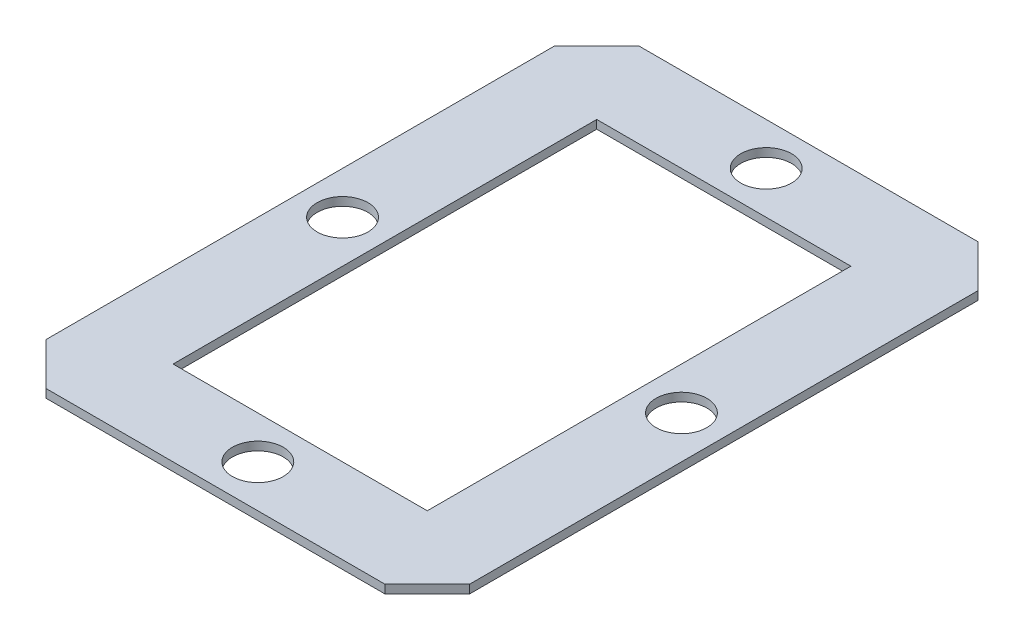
from build123d import *

# Parameters (mm, degrees)
SKETCH1_W          = 100
SKETCH1_H          = 140
EXTRUDE1_DEPTH     = 2
SKETCH2_R          = 6
CUT_EXTRUDE1_DEPTH = 87.046499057
CHAMFER1_SIZE      = 10
CUT_EXTRUDE2_REACH = 88.046
SKETCH3_W          = 60
SKETCH3_H          = 100


with BuildPart() as part:
    # Sketch1 → Extrude1 (new body)
    with BuildSketch(Plane(origin=(0, 0, 0), x_dir=(1, 0, 0), z_dir=(0, 1, 0))):
        Rectangle(SKETCH1_W, SKETCH1_H)
    extrude(amount=EXTRUDE1_DEPTH)

    # Sketch2 → Cut-Extrude1 (cut, through all)
    with BuildSketch(Plane(origin=(0, 2, 0), x_dir=(1, 0, 0), z_dir=(0, 1, 0))):
        with Locations(Location((0, 60, 0), (0, 0, 270))):
            Circle(SKETCH2_R)
        with Locations(Location((40, 0, 0), (0, 0, 270))):
            Circle(SKETCH2_R)
        with Locations(Location((0, -60, 0), (0, 0, 270))):
            Circle(SKETCH2_R)
        with Locations(Location((-40, 0, 0), (0, 0, 270))):
            Circle(SKETCH2_R)
    extrude(amount=-CUT_EXTRUDE1_DEPTH, mode=Mode.SUBTRACT)

    # Chamfer1
    chamfer1_edges = [part.edges().sort_by_distance(p)[0] for p in [
        (50, 1, -70),
        (50, 1, 70),
        (-50, 1, 70),
        (-50, 1, -70),
    ]]
    chamfer(chamfer1_edges, length=CHAMFER1_SIZE)

    # Sketch3 → Cut-Extrude2 (cut, up to next)
    with BuildSketch(Plane.XZ, mode=Mode.PRIVATE) as cut_extrude2_sk1:
        Rectangle(SKETCH3_W, SKETCH3_H)
    cut_extrude2_tool1 = extrude(cut_extrude2_sk1.sketch, amount=-CUT_EXTRUDE2_REACH, mode=Mode.PRIVATE) & part.part
    add(cut_extrude2_tool1.solids().sort_by_distance((0, 0, 0))[0], mode=Mode.SUBTRACT)


solid = part.part
